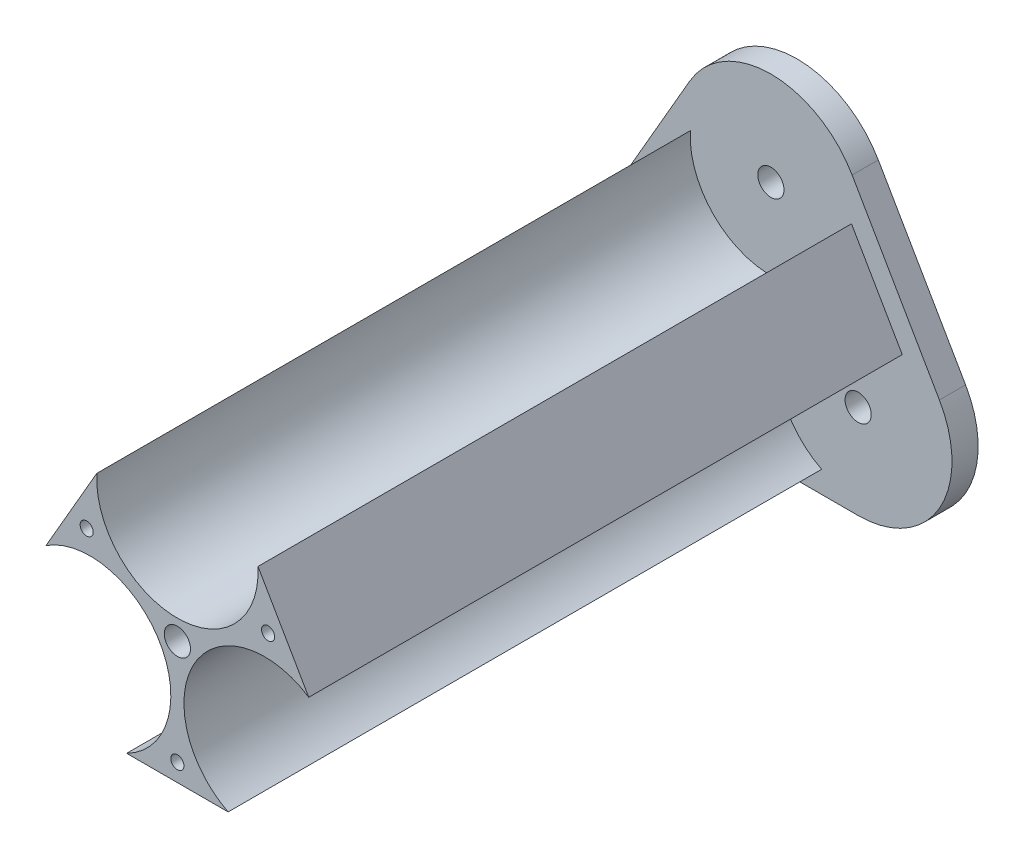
from build123d import *

# Parameters (mm, degrees)
EXTRUDE_1_DEPTH     = 3
SKETCH_2_R          = 1.5
EXTRUDE_2_DEPTH     = 68
SKETCH_3_R          = 0.75
CUT_EXTRUDE_1_DEPTH = 15
SKETCH_4_R          = 1.5
CUT_EXTRUDE_2_DEPTH = 82.003668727
SKETCH_5_R          = 1.5
CUT_EXTRUDE_3_DEPTH = 82.003668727


with BuildPart() as part:
    # Sketch 1 → Extrude 1 (new body)
    with BuildSketch(Plane.XY):
        with BuildLine():
            Line((-10, 0), (10, 0))
            ThreePointArc((10, 0), (19.309773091, 5.375), (19.309773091, 16.125))
            Line((19.309773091, 16.125), (9.309773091, 33.445508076))
            ThreePointArc((9.309773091, 33.445508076), (0, 38.820508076), (-9.309773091, 33.445508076))
            Line((-9.309773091, 33.445508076), (-19.309773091, 16.125))
            ThreePointArc((-19.309773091, 16.125), (-19.309773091, 5.375), (-10, 0))
        make_face()
    extrude(amount=EXTRUDE_1_DEPTH)

    # Sketch 2 → Extrude 2 (add)
    with BuildSketch(Plane.XY.offset(3)):
        with BuildLine():
            Line((-5.816699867, 2.5), (5.816699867, 2.5))
            ThreePointArc((5.816699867, 2.5), (1.989265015, 15.375), (15.053059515, 18.497844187))
            Line((15.053059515, 18.497844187), (9.236359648, 28.572663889))
            ThreePointArc((9.236359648, 28.572663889), (0, 18.820508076), (-9.236359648, 28.572663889))
            Line((-9.236359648, 28.572663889), (-15.053059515, 18.497844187))
            ThreePointArc((-15.053059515, 18.497844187), (-1.989265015, 15.375), (-5.816699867, 2.5))
        make_face()
        with Locations((0, 16.523502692)):
            Circle(SKETCH_2_R, mode=Mode.SUBTRACT)
    extrude(amount=EXTRUDE_2_DEPTH)

    # Sketch 3 → Cut-Extrude 1 (cut)
    with BuildSketch(Plane.XY.offset(71)):
        with Locations((10.392304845, 22.523502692)):
            Circle(SKETCH_3_R)
        with Locations((0, 4.523502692)):
            Circle(SKETCH_3_R)
        with Locations((-10.392304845, 22.523502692)):
            Circle(SKETCH_3_R)
    extrude(amount=-CUT_EXTRUDE_1_DEPTH, mode=Mode.SUBTRACT)

    # Sketch 4 → Cut-Extrude 2 (cut, through all)
    with BuildSketch(Plane.XY.offset(3)):
        with Locations((0, 28.070508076)):
            Circle(SKETCH_4_R)
        with Locations((10, 10.75)):
            Circle(SKETCH_4_R)
        with Locations((-10, 10.75)):
            Circle(SKETCH_4_R)
    extrude(amount=-CUT_EXTRUDE_2_DEPTH, mode=Mode.SUBTRACT)

    # Sketch 5 → Cut-Extrude 3 (cut, through all)
    with BuildSketch(Plane.XY.offset(3)):
        with Locations((0, 16.523502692)):
            Circle(SKETCH_5_R)
    extrude(amount=-CUT_EXTRUDE_3_DEPTH, mode=Mode.SUBTRACT)


solid = part.part
